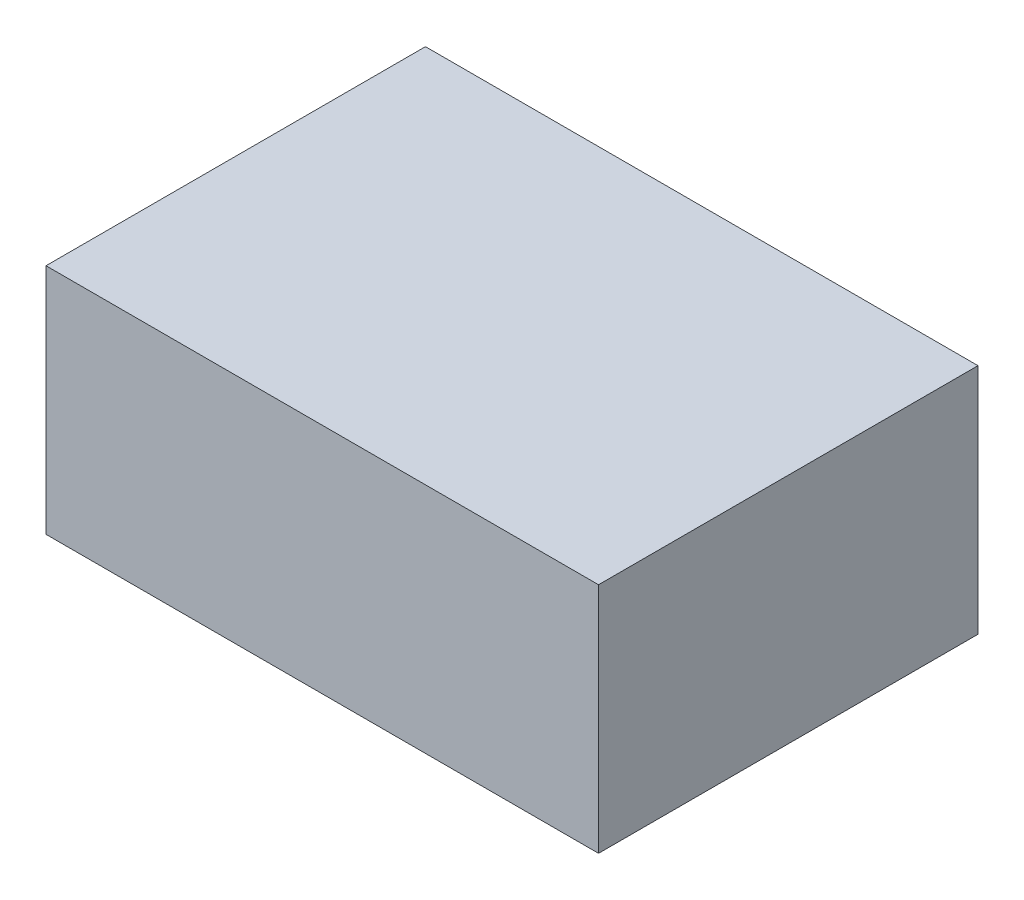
ISO-10303-21;
HEADER;
FILE_DESCRIPTION(('STEP AP214'),'2;1');
FILE_NAME('part.step','',(''),(''),'','','');
FILE_SCHEMA(('AUTOMOTIVE_DESIGN { 1 0 10303 214 1 1 1 1 }'));
ENDSEC;
DATA;
#1=APPLICATION_CONTEXT('core data for automotive mechanical design processes');
#2=APPLICATION_PROTOCOL_DEFINITION('international standard','automotive_design',2000,#1);
#3=PRODUCT_CONTEXT('',#1,'mechanical');
#4=PRODUCT('Part','Part','',(#3));
#5=PRODUCT_RELATED_PRODUCT_CATEGORY('part','',(#4));
#6=PRODUCT_DEFINITION_FORMATION('','',#4);
#7=PRODUCT_DEFINITION_CONTEXT('part definition',#1,'design');
#8=PRODUCT_DEFINITION('design','',#6,#7);
#9=PRODUCT_DEFINITION_SHAPE('','',#8);
#10=(LENGTH_UNIT() NAMED_UNIT(*) SI_UNIT(.MILLI.,.METRE.));
#11=(NAMED_UNIT(*) PLANE_ANGLE_UNIT() SI_UNIT($,.RADIAN.));
#12=(NAMED_UNIT(*) SI_UNIT($,.STERADIAN.) SOLID_ANGLE_UNIT());
#13=UNCERTAINTY_MEASURE_WITH_UNIT(LENGTH_MEASURE(1.E-05),#10,'distance_accuracy_value','');
#14=(GEOMETRIC_REPRESENTATION_CONTEXT(3) GLOBAL_UNCERTAINTY_ASSIGNED_CONTEXT((#13)) GLOBAL_UNIT_ASSIGNED_CONTEXT((#10,
#11,#12)) REPRESENTATION_CONTEXT('',''));
#15=CARTESIAN_POINT('',(0.,0.,0.));
#16=DIRECTION('',(0.,0.,1.));
#17=DIRECTION('',(1.,0.,0.));
#18=AXIS2_PLACEMENT_3D('',#15,#16,#17);
#19=CARTESIAN_POINT('',(0.,39.,0.));
#20=DIRECTION('',(1.,0.,0.));
#21=DIRECTION('',(0.,0.,-1.));
#22=AXIS2_PLACEMENT_3D('',#19,#20,#21);
#23=PLANE('',#22);
#24=DIRECTION('',(0.,0.,1.));
#25=VECTOR('',#24,1.);
#26=CARTESIAN_POINT('',(0.,0.,0.));
#27=LINE('',#26,#25);
#28=CARTESIAN_POINT('',(0.,0.,0.));
#29=VERTEX_POINT('',#28);
#30=CARTESIAN_POINT('',(0.,0.,63.6166110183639));
#31=VERTEX_POINT('',#30);
#32=EDGE_CURVE('E77',#29,#31,#27,.T.);
#33=ORIENTED_EDGE('',*,*,#32,.T.);
#34=DIRECTION('',(0.,-1.,0.));
#35=VECTOR('',#34,1.);
#36=CARTESIAN_POINT('',(0.,39.,63.6166110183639));
#37=LINE('',#36,#35);
#38=CARTESIAN_POINT('',(0.,39.,63.6166110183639));
#39=VERTEX_POINT('',#38);
#40=EDGE_CURVE('E11',#39,#31,#37,.T.);
#41=ORIENTED_EDGE('',*,*,#40,.F.);
#42=DIRECTION('',(0.,0.,1.));
#43=VECTOR('',#42,1.);
#44=CARTESIAN_POINT('',(0.,39.,0.));
#45=LINE('',#44,#43);
#46=CARTESIAN_POINT('',(0.,39.,0.));
#47=VERTEX_POINT('',#46);
#48=EDGE_CURVE('E95',#47,#39,#45,.T.);
#49=ORIENTED_EDGE('',*,*,#48,.F.);
#50=DIRECTION('',(0.,-1.,0.));
#51=VECTOR('',#50,1.);
#52=CARTESIAN_POINT('',(0.,39.,0.));
#53=LINE('',#52,#51);
#54=EDGE_CURVE('E89',#47,#29,#53,.T.);
#55=ORIENTED_EDGE('',*,*,#54,.T.);
#56=EDGE_LOOP('',(#33,#41,#49,#55));
#57=FACE_BOUND('',#56,.T.);
#58=ADVANCED_FACE('F33',(#57),#23,.F.);
#59=CARTESIAN_POINT('',(0.,39.,63.6166110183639));
#60=DIRECTION('',(0.,0.,-1.));
#61=DIRECTION('',(-1.,0.,0.));
#62=AXIS2_PLACEMENT_3D('',#59,#60,#61);
#63=PLANE('',#62);
#64=DIRECTION('',(1.,0.,0.));
#65=VECTOR('',#64,1.);
#66=CARTESIAN_POINT('',(0.,0.,63.6166110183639));
#67=LINE('',#66,#65);
#68=CARTESIAN_POINT('',(92.6315525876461,0.,63.6166110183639));
#69=VERTEX_POINT('',#68);
#70=EDGE_CURVE('E73',#31,#69,#67,.T.);
#71=ORIENTED_EDGE('',*,*,#70,.T.);
#72=DIRECTION('',(0.,-1.,0.));
#73=VECTOR('',#72,1.);
#74=CARTESIAN_POINT('',(92.6315525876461,39.,63.6166110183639));
#75=LINE('',#74,#73);
#76=CARTESIAN_POINT('',(92.6315525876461,39.,63.6166110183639));
#77=VERTEX_POINT('',#76);
#78=EDGE_CURVE('E40',#77,#69,#75,.T.);
#79=ORIENTED_EDGE('',*,*,#78,.F.);
#80=DIRECTION('',(1.,0.,0.));
#81=VECTOR('',#80,1.);
#82=CARTESIAN_POINT('',(0.,39.,63.6166110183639));
#83=LINE('',#82,#81);
#84=EDGE_CURVE('E85',#39,#77,#83,.T.);
#85=ORIENTED_EDGE('',*,*,#84,.F.);
#86=ORIENTED_EDGE('',*,*,#40,.T.);
#87=EDGE_LOOP('',(#71,#79,#85,#86));
#88=FACE_BOUND('',#87,.T.);
#89=ADVANCED_FACE('F84',(#88),#63,.F.);
#90=CARTESIAN_POINT('',(92.6315525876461,39.,0.));
#91=DIRECTION('',(-1.,0.,0.));
#92=DIRECTION('',(0.,0.,1.));
#93=AXIS2_PLACEMENT_3D('',#90,#91,#92);
#94=PLANE('',#93);
#95=DIRECTION('',(0.,0.,-1.));
#96=VECTOR('',#95,1.);
#97=CARTESIAN_POINT('',(92.6315525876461,0.,0.));
#98=LINE('',#97,#96);
#99=CARTESIAN_POINT('',(92.6315525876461,0.,0.));
#100=VERTEX_POINT('',#99);
#101=EDGE_CURVE('E78',#69,#100,#98,.T.);
#102=ORIENTED_EDGE('',*,*,#101,.T.);
#103=DIRECTION('',(0.,-1.,0.));
#104=VECTOR('',#103,1.);
#105=CARTESIAN_POINT('',(92.6315525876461,39.,0.));
#106=LINE('',#105,#104);
#107=CARTESIAN_POINT('',(92.6315525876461,39.,0.));
#108=VERTEX_POINT('',#107);
#109=EDGE_CURVE('E101',#108,#100,#106,.T.);
#110=ORIENTED_EDGE('',*,*,#109,.F.);
#111=DIRECTION('',(0.,0.,-1.));
#112=VECTOR('',#111,1.);
#113=CARTESIAN_POINT('',(92.6315525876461,39.,0.));
#114=LINE('',#113,#112);
#115=EDGE_CURVE('E52',#77,#108,#114,.T.);
#116=ORIENTED_EDGE('',*,*,#115,.F.);
#117=ORIENTED_EDGE('',*,*,#78,.T.);
#118=EDGE_LOOP('',(#102,#110,#116,#117));
#119=FACE_BOUND('',#118,.T.);
#120=ADVANCED_FACE('F104',(#119),#94,.F.);
#121=CARTESIAN_POINT('',(0.,39.,0.));
#122=DIRECTION('',(0.,0.,1.));
#123=DIRECTION('',(1.,0.,0.));
#124=AXIS2_PLACEMENT_3D('',#121,#122,#123);
#125=PLANE('',#124);
#126=DIRECTION('',(-1.,0.,0.));
#127=VECTOR('',#126,1.);
#128=CARTESIAN_POINT('',(0.,0.,0.));
#129=LINE('',#128,#127);
#130=EDGE_CURVE('E93',#100,#29,#129,.T.);
#131=ORIENTED_EDGE('',*,*,#130,.T.);
#132=ORIENTED_EDGE('',*,*,#54,.F.);
#133=DIRECTION('',(-1.,0.,0.));
#134=VECTOR('',#133,1.);
#135=CARTESIAN_POINT('',(0.,39.,0.));
#136=LINE('',#135,#134);
#137=EDGE_CURVE('E47',#108,#47,#136,.T.);
#138=ORIENTED_EDGE('',*,*,#137,.F.);
#139=ORIENTED_EDGE('',*,*,#109,.T.);
#140=EDGE_LOOP('',(#131,#132,#138,#139));
#141=FACE_BOUND('',#140,.T.);
#142=ADVANCED_FACE('F106',(#141),#125,.F.);
#143=CARTESIAN_POINT('',(0.,39.,63.6166110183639));
#144=DIRECTION('',(0.,1.,0.));
#145=DIRECTION('',(0.,0.,1.));
#146=AXIS2_PLACEMENT_3D('',#143,#144,#145);
#147=PLANE('',#146);
#148=ORIENTED_EDGE('',*,*,#48,.T.);
#149=ORIENTED_EDGE('',*,*,#84,.T.);
#150=ORIENTED_EDGE('',*,*,#115,.T.);
#151=ORIENTED_EDGE('',*,*,#137,.T.);
#152=EDGE_LOOP('',(#148,#149,#150,#151));
#153=FACE_BOUND('',#152,.T.);
#154=ADVANCED_FACE('F107',(#153),#147,.T.);
#155=CARTESIAN_POINT('',(0.,0.,63.6166110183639));
#156=DIRECTION('',(0.,1.,0.));
#157=DIRECTION('',(0.,0.,1.));
#158=AXIS2_PLACEMENT_3D('',#155,#156,#157);
#159=PLANE('',#158);
#160=ORIENTED_EDGE('',*,*,#32,.F.);
#161=ORIENTED_EDGE('',*,*,#130,.F.);
#162=ORIENTED_EDGE('',*,*,#101,.F.);
#163=ORIENTED_EDGE('',*,*,#70,.F.);
#164=EDGE_LOOP('',(#160,#161,#162,#163));
#165=FACE_BOUND('',#164,.T.);
#166=ADVANCED_FACE('F74',(#165),#159,.F.);
#167=CLOSED_SHELL('',(#58,#89,#120,#142,#154,#166));
#168=MANIFOLD_SOLID_BREP('B2',#167);
#169=ADVANCED_BREP_SHAPE_REPRESENTATION('',(#18,#168),#14);
#170=SHAPE_DEFINITION_REPRESENTATION(#9,#169);
ENDSEC;
END-ISO-10303-21;
